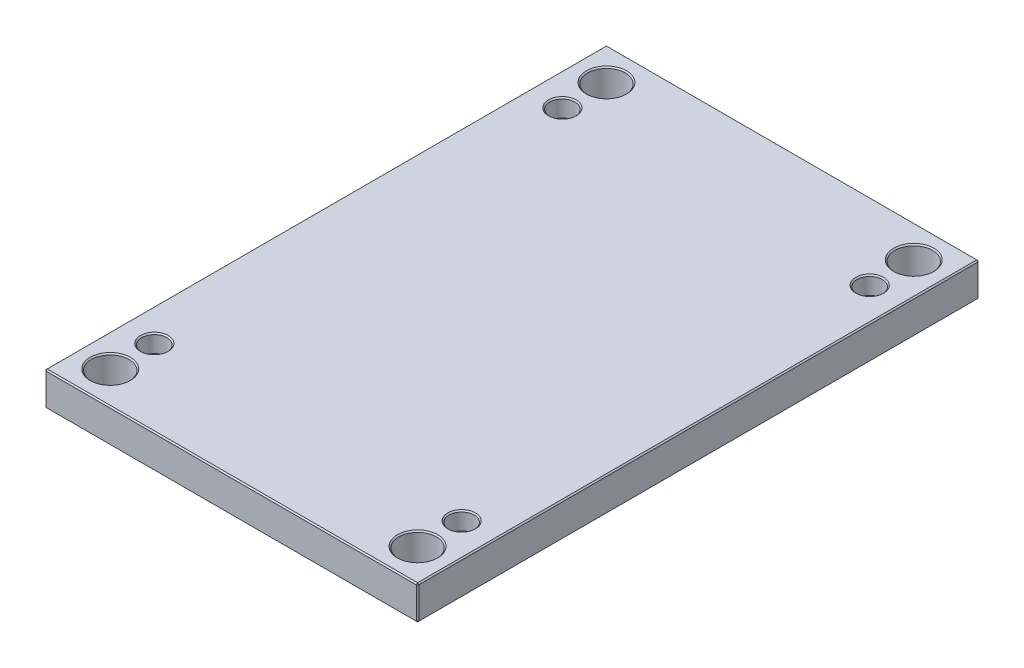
ISO-10303-21;
HEADER;
FILE_DESCRIPTION(('STEP AP214'),'2;1');
FILE_NAME('part.step','',(''),(''),'','','');
FILE_SCHEMA(('AUTOMOTIVE_DESIGN { 1 0 10303 214 1 1 1 1 }'));
ENDSEC;
DATA;
#1=APPLICATION_CONTEXT('core data for automotive mechanical design processes');
#2=APPLICATION_PROTOCOL_DEFINITION('international standard','automotive_design',2000,#1);
#3=PRODUCT_CONTEXT('',#1,'mechanical');
#4=PRODUCT('Part','Part','',(#3));
#5=PRODUCT_RELATED_PRODUCT_CATEGORY('part','',(#4));
#6=PRODUCT_DEFINITION_FORMATION('','',#4);
#7=PRODUCT_DEFINITION_CONTEXT('part definition',#1,'design');
#8=PRODUCT_DEFINITION('design','',#6,#7);
#9=PRODUCT_DEFINITION_SHAPE('','',#8);
#10=(LENGTH_UNIT() NAMED_UNIT(*) SI_UNIT(.MILLI.,.METRE.));
#11=(NAMED_UNIT(*) PLANE_ANGLE_UNIT() SI_UNIT($,.RADIAN.));
#12=(NAMED_UNIT(*) SI_UNIT($,.STERADIAN.) SOLID_ANGLE_UNIT());
#13=UNCERTAINTY_MEASURE_WITH_UNIT(LENGTH_MEASURE(1.E-05),#10,'distance_accuracy_value','');
#14=(GEOMETRIC_REPRESENTATION_CONTEXT(3) GLOBAL_UNCERTAINTY_ASSIGNED_CONTEXT((#13)) GLOBAL_UNIT_ASSIGNED_CONTEXT((#10,
#11,#12)) REPRESENTATION_CONTEXT('',''));
#15=CARTESIAN_POINT('',(0.,0.,0.));
#16=DIRECTION('',(0.,0.,1.));
#17=DIRECTION('',(1.,0.,0.));
#18=AXIS2_PLACEMENT_3D('',#15,#16,#17);
#19=CARTESIAN_POINT('',(-148.,27.,223.));
#20=DIRECTION('',(1.,0.,0.));
#21=DIRECTION('',(0.,0.,-1.));
#22=AXIS2_PLACEMENT_3D('',#19,#20,#21);
#23=PLANE('',#22);
#24=DIRECTION('',(0.,-1.,0.));
#25=VECTOR('',#24,1.);
#26=CARTESIAN_POINT('',(-148.,27.,-222.));
#27=LINE('',#26,#25);
#28=CARTESIAN_POINT('',(-148.,26.,-222.));
#29=VERTEX_POINT('',#28);
#30=CARTESIAN_POINT('',(-148.,1.,-222.));
#31=VERTEX_POINT('',#30);
#32=EDGE_CURVE('E115',#29,#31,#27,.T.);
#33=ORIENTED_EDGE('',*,*,#32,.T.);
#34=DIRECTION('',(0.,0.,1.));
#35=VECTOR('',#34,1.);
#36=CARTESIAN_POINT('',(-148.,1.,223.));
#37=LINE('',#36,#35);
#38=CARTESIAN_POINT('',(-148.,1.,222.));
#39=VERTEX_POINT('',#38);
#40=EDGE_CURVE('E111',#31,#39,#37,.T.);
#41=ORIENTED_EDGE('',*,*,#40,.T.);
#42=DIRECTION('',(0.,1.,0.));
#43=VECTOR('',#42,1.);
#44=CARTESIAN_POINT('',(-148.,27.,222.));
#45=LINE('',#44,#43);
#46=CARTESIAN_POINT('',(-148.,26.,222.));
#47=VERTEX_POINT('',#46);
#48=EDGE_CURVE('E104',#39,#47,#45,.T.);
#49=ORIENTED_EDGE('',*,*,#48,.T.);
#50=DIRECTION('',(0.,0.,-1.));
#51=VECTOR('',#50,1.);
#52=CARTESIAN_POINT('',(-148.,26.,-223.));
#53=LINE('',#52,#51);
#54=EDGE_CURVE('E108',#47,#29,#53,.T.);
#55=ORIENTED_EDGE('',*,*,#54,.T.);
#56=EDGE_LOOP('',(#33,#41,#49,#55));
#57=FACE_BOUND('',#56,.T.);
#58=ADVANCED_FACE('F16',(#57),#23,.F.);
#59=CARTESIAN_POINT('',(148.,27.,223.));
#60=DIRECTION('',(0.,0.,-1.));
#61=DIRECTION('',(-1.,0.,0.));
#62=AXIS2_PLACEMENT_3D('',#59,#60,#61);
#63=PLANE('',#62);
#64=DIRECTION('',(-1.,0.,0.));
#65=VECTOR('',#64,1.);
#66=CARTESIAN_POINT('',(-148.,26.,223.));
#67=LINE('',#66,#65);
#68=CARTESIAN_POINT('',(147.,26.,223.));
#69=VERTEX_POINT('',#68);
#70=CARTESIAN_POINT('',(-147.,26.,223.));
#71=VERTEX_POINT('',#70);
#72=EDGE_CURVE('E170',#69,#71,#67,.T.);
#73=ORIENTED_EDGE('',*,*,#72,.T.);
#74=DIRECTION('',(0.,-1.,0.));
#75=VECTOR('',#74,1.);
#76=CARTESIAN_POINT('',(-147.,27.,223.));
#77=LINE('',#76,#75);
#78=CARTESIAN_POINT('',(-147.,0.999999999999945,223.));
#79=VERTEX_POINT('',#78);
#80=EDGE_CURVE('E123',#71,#79,#77,.T.);
#81=ORIENTED_EDGE('',*,*,#80,.T.);
#82=DIRECTION('',(1.,0.,0.));
#83=VECTOR('',#82,1.);
#84=CARTESIAN_POINT('',(148.,0.999999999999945,223.));
#85=LINE('',#84,#83);
#86=CARTESIAN_POINT('',(147.,0.999999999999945,223.));
#87=VERTEX_POINT('',#86);
#88=EDGE_CURVE('E174',#79,#87,#85,.T.);
#89=ORIENTED_EDGE('',*,*,#88,.T.);
#90=DIRECTION('',(0.,1.,0.));
#91=VECTOR('',#90,1.);
#92=CARTESIAN_POINT('',(147.,27.,223.));
#93=LINE('',#92,#91);
#94=EDGE_CURVE('E172',#87,#69,#93,.T.);
#95=ORIENTED_EDGE('',*,*,#94,.T.);
#96=EDGE_LOOP('',(#73,#81,#89,#95));
#97=FACE_BOUND('',#96,.T.);
#98=ADVANCED_FACE('F413',(#97),#63,.F.);
#99=CARTESIAN_POINT('',(148.,27.,223.));
#100=DIRECTION('',(-1.,0.,0.));
#101=DIRECTION('',(0.,0.,1.));
#102=AXIS2_PLACEMENT_3D('',#99,#100,#101);
#103=PLANE('',#102);
#104=DIRECTION('',(0.,0.,-1.));
#105=VECTOR('',#104,1.);
#106=CARTESIAN_POINT('',(148.,0.999999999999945,223.));
#107=LINE('',#106,#105);
#108=CARTESIAN_POINT('',(148.,0.999999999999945,222.));
#109=VERTEX_POINT('',#108);
#110=CARTESIAN_POINT('',(148.,0.999999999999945,-222.));
#111=VERTEX_POINT('',#110);
#112=EDGE_CURVE('E165',#109,#111,#107,.T.);
#113=ORIENTED_EDGE('',*,*,#112,.T.);
#114=DIRECTION('',(0.,1.,0.));
#115=VECTOR('',#114,1.);
#116=CARTESIAN_POINT('',(148.,27.,-222.));
#117=LINE('',#116,#115);
#118=CARTESIAN_POINT('',(148.,26.,-222.));
#119=VERTEX_POINT('',#118);
#120=EDGE_CURVE('E167',#111,#119,#117,.T.);
#121=ORIENTED_EDGE('',*,*,#120,.T.);
#122=DIRECTION('',(0.,0.,1.));
#123=VECTOR('',#122,1.);
#124=CARTESIAN_POINT('',(148.,26.,223.));
#125=LINE('',#124,#123);
#126=CARTESIAN_POINT('',(148.,26.,222.));
#127=VERTEX_POINT('',#126);
#128=EDGE_CURVE('E161',#119,#127,#125,.T.);
#129=ORIENTED_EDGE('',*,*,#128,.T.);
#130=DIRECTION('',(0.,-1.,0.));
#131=VECTOR('',#130,1.);
#132=CARTESIAN_POINT('',(148.,27.,222.));
#133=LINE('',#132,#131);
#134=EDGE_CURVE('E163',#127,#109,#133,.T.);
#135=ORIENTED_EDGE('',*,*,#134,.T.);
#136=EDGE_LOOP('',(#113,#121,#129,#135));
#137=FACE_BOUND('',#136,.T.);
#138=ADVANCED_FACE('F406',(#137),#103,.F.);
#139=CARTESIAN_POINT('',(148.,27.,-223.));
#140=DIRECTION('',(0.,0.,1.));
#141=DIRECTION('',(1.,0.,0.));
#142=AXIS2_PLACEMENT_3D('',#139,#140,#141);
#143=PLANE('',#142);
#144=DIRECTION('',(0.,-1.,0.));
#145=VECTOR('',#144,1.);
#146=CARTESIAN_POINT('',(147.,27.,-223.));
#147=LINE('',#146,#145);
#148=CARTESIAN_POINT('',(147.,26.,-223.));
#149=VERTEX_POINT('',#148);
#150=CARTESIAN_POINT('',(147.,0.999999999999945,-223.));
#151=VERTEX_POINT('',#150);
#152=EDGE_CURVE('E154',#149,#151,#147,.T.);
#153=ORIENTED_EDGE('',*,*,#152,.T.);
#154=DIRECTION('',(-1.,0.,0.));
#155=VECTOR('',#154,1.);
#156=CARTESIAN_POINT('',(148.,0.999999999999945,-223.));
#157=LINE('',#156,#155);
#158=CARTESIAN_POINT('',(-147.,0.999999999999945,-223.));
#159=VERTEX_POINT('',#158);
#160=EDGE_CURVE('E159',#151,#159,#157,.T.);
#161=ORIENTED_EDGE('',*,*,#160,.T.);
#162=DIRECTION('',(0.,1.,0.));
#163=VECTOR('',#162,1.);
#164=CARTESIAN_POINT('',(-147.,27.,-223.));
#165=LINE('',#164,#163);
#166=CARTESIAN_POINT('',(-147.,26.,-223.));
#167=VERTEX_POINT('',#166);
#168=EDGE_CURVE('E156',#159,#167,#165,.T.);
#169=ORIENTED_EDGE('',*,*,#168,.T.);
#170=DIRECTION('',(1.,0.,0.));
#171=VECTOR('',#170,1.);
#172=CARTESIAN_POINT('',(148.,26.,-223.));
#173=LINE('',#172,#171);
#174=EDGE_CURVE('E152',#167,#149,#173,.T.);
#175=ORIENTED_EDGE('',*,*,#174,.T.);
#176=EDGE_LOOP('',(#153,#161,#169,#175));
#177=FACE_BOUND('',#176,.T.);
#178=ADVANCED_FACE('F431',(#177),#143,.F.);
#179=CARTESIAN_POINT('',(0.,27.,0.));
#180=DIRECTION('',(0.,1.,0.));
#181=DIRECTION('',(0.,0.,1.));
#182=AXIS2_PLACEMENT_3D('',#179,#180,#181);
#183=PLANE('',#182);
#184=CARTESIAN_POINT('',(-122.,27.,197.));
#185=DIRECTION('',(0.,1.,0.));
#186=DIRECTION('',(0.,0.,1.));
#187=AXIS2_PLACEMENT_3D('',#184,#185,#186);
#188=CIRCLE('',#187,16.);
#189=CARTESIAN_POINT('',(-122.,27.,213.));
#190=VERTEX_POINT('',#189);
#191=EDGE_CURVE('E317',#190,#190,#188,.F.);
#192=ORIENTED_EDGE('',*,*,#191,.T.);
#193=EDGE_LOOP('',(#192));
#194=FACE_BOUND('',#193,.T.);
#195=CARTESIAN_POINT('',(122.,27.,197.));
#196=DIRECTION('',(0.,1.,0.));
#197=DIRECTION('',(0.,0.,1.));
#198=AXIS2_PLACEMENT_3D('',#195,#196,#197);
#199=CIRCLE('',#198,16.);
#200=CARTESIAN_POINT('',(122.,27.,213.));
#201=VERTEX_POINT('',#200);
#202=EDGE_CURVE('E314',#201,#201,#199,.F.);
#203=ORIENTED_EDGE('',*,*,#202,.T.);
#204=EDGE_LOOP('',(#203));
#205=FACE_BOUND('',#204,.T.);
#206=CARTESIAN_POINT('',(122.,27.,-197.));
#207=DIRECTION('',(0.,1.,0.));
#208=DIRECTION('',(0.,0.,1.));
#209=AXIS2_PLACEMENT_3D('',#206,#207,#208);
#210=CIRCLE('',#209,16.);
#211=CARTESIAN_POINT('',(122.,27.,-181.));
#212=VERTEX_POINT('',#211);
#213=EDGE_CURVE('E311',#212,#212,#210,.F.);
#214=ORIENTED_EDGE('',*,*,#213,.T.);
#215=EDGE_LOOP('',(#214));
#216=FACE_BOUND('',#215,.T.);
#217=CARTESIAN_POINT('',(-122.,27.,-197.));
#218=DIRECTION('',(0.,1.,0.));
#219=DIRECTION('',(0.,0.,1.));
#220=AXIS2_PLACEMENT_3D('',#217,#218,#219);
#221=CIRCLE('',#220,16.);
#222=CARTESIAN_POINT('',(-122.,27.,-181.));
#223=VERTEX_POINT('',#222);
#224=EDGE_CURVE('E308',#223,#223,#221,.F.);
#225=ORIENTED_EDGE('',*,*,#224,.T.);
#226=EDGE_LOOP('',(#225));
#227=FACE_BOUND('',#226,.T.);
#228=CARTESIAN_POINT('',(-122.,27.,162.));
#229=DIRECTION('',(0.,1.,0.));
#230=DIRECTION('',(0.,0.,1.));
#231=AXIS2_PLACEMENT_3D('',#228,#229,#230);
#232=CIRCLE('',#231,11.);
#233=CARTESIAN_POINT('',(-122.,27.,173.));
#234=VERTEX_POINT('',#233);
#235=EDGE_CURVE('E290',#234,#234,#232,.F.);
#236=ORIENTED_EDGE('',*,*,#235,.T.);
#237=EDGE_LOOP('',(#236));
#238=FACE_BOUND('',#237,.T.);
#239=CARTESIAN_POINT('',(122.,27.,162.));
#240=DIRECTION('',(0.,1.,0.));
#241=DIRECTION('',(0.,0.,1.));
#242=AXIS2_PLACEMENT_3D('',#239,#240,#241);
#243=CIRCLE('',#242,11.);
#244=CARTESIAN_POINT('',(122.,27.,173.));
#245=VERTEX_POINT('',#244);
#246=EDGE_CURVE('E287',#245,#245,#243,.F.);
#247=ORIENTED_EDGE('',*,*,#246,.T.);
#248=EDGE_LOOP('',(#247));
#249=FACE_BOUND('',#248,.T.);
#250=CARTESIAN_POINT('',(122.,27.,-162.));
#251=DIRECTION('',(0.,1.,0.));
#252=DIRECTION('',(0.,0.,1.));
#253=AXIS2_PLACEMENT_3D('',#250,#251,#252);
#254=CIRCLE('',#253,11.);
#255=CARTESIAN_POINT('',(122.,27.,-151.));
#256=VERTEX_POINT('',#255);
#257=EDGE_CURVE('E284',#256,#256,#254,.F.);
#258=ORIENTED_EDGE('',*,*,#257,.T.);
#259=EDGE_LOOP('',(#258));
#260=FACE_BOUND('',#259,.T.);
#261=CARTESIAN_POINT('',(-122.,27.,-162.));
#262=DIRECTION('',(0.,1.,0.));
#263=DIRECTION('',(0.,0.,1.));
#264=AXIS2_PLACEMENT_3D('',#261,#262,#263);
#265=CIRCLE('',#264,11.);
#266=CARTESIAN_POINT('',(-122.,27.,-151.));
#267=VERTEX_POINT('',#266);
#268=EDGE_CURVE('E281',#267,#267,#265,.F.);
#269=ORIENTED_EDGE('',*,*,#268,.T.);
#270=EDGE_LOOP('',(#269));
#271=FACE_BOUND('',#270,.T.);
#272=DIRECTION('',(0.,0.,-1.));
#273=VECTOR('',#272,1.);
#274=CARTESIAN_POINT('',(147.,27.,-223.));
#275=LINE('',#274,#273);
#276=CARTESIAN_POINT('',(147.,27.,222.));
#277=VERTEX_POINT('',#276);
#278=CARTESIAN_POINT('',(147.,27.,-222.));
#279=VERTEX_POINT('',#278);
#280=EDGE_CURVE('E31',#277,#279,#275,.T.);
#281=ORIENTED_EDGE('',*,*,#280,.T.);
#282=DIRECTION('',(-1.,0.,0.));
#283=VECTOR('',#282,1.);
#284=CARTESIAN_POINT('',(-148.,27.,-222.));
#285=LINE('',#284,#283);
#286=CARTESIAN_POINT('',(-147.,27.,-222.));
#287=VERTEX_POINT('',#286);
#288=EDGE_CURVE('E190',#279,#287,#285,.T.);
#289=ORIENTED_EDGE('',*,*,#288,.T.);
#290=DIRECTION('',(0.,0.,1.));
#291=VECTOR('',#290,1.);
#292=CARTESIAN_POINT('',(-147.,27.,223.));
#293=LINE('',#292,#291);
#294=CARTESIAN_POINT('',(-147.,27.,222.));
#295=VERTEX_POINT('',#294);
#296=EDGE_CURVE('E186',#287,#295,#293,.T.);
#297=ORIENTED_EDGE('',*,*,#296,.T.);
#298=DIRECTION('',(1.,0.,0.));
#299=VECTOR('',#298,1.);
#300=CARTESIAN_POINT('',(148.,27.,222.));
#301=LINE('',#300,#299);
#302=EDGE_CURVE('E36',#295,#277,#301,.T.);
#303=ORIENTED_EDGE('',*,*,#302,.T.);
#304=EDGE_LOOP('',(#281,#289,#297,#303));
#305=FACE_BOUND('',#304,.T.);
#306=ADVANCED_FACE('F357',(#194,#205,#216,#227,#238,#249,#260,#271,#305),#183,.T.);
#307=CARTESIAN_POINT('',(0.,0.,0.));
#308=DIRECTION('',(0.,1.,0.));
#309=DIRECTION('',(0.,0.,1.));
#310=AXIS2_PLACEMENT_3D('',#307,#308,#309);
#311=PLANE('',#310);
#312=CARTESIAN_POINT('',(-122.,0.,197.));
#313=DIRECTION('',(0.,1.,0.));
#314=DIRECTION('',(0.,0.,1.));
#315=AXIS2_PLACEMENT_3D('',#312,#313,#314);
#316=CIRCLE('',#315,16.);
#317=CARTESIAN_POINT('',(-122.,0.,213.));
#318=VERTEX_POINT('',#317);
#319=EDGE_CURVE('E329',#318,#318,#316,.T.);
#320=ORIENTED_EDGE('',*,*,#319,.T.);
#321=EDGE_LOOP('',(#320));
#322=FACE_BOUND('',#321,.T.);
#323=CARTESIAN_POINT('',(122.,0.,197.));
#324=DIRECTION('',(0.,1.,0.));
#325=DIRECTION('',(0.,0.,1.));
#326=AXIS2_PLACEMENT_3D('',#323,#324,#325);
#327=CIRCLE('',#326,16.);
#328=CARTESIAN_POINT('',(122.,0.,213.));
#329=VERTEX_POINT('',#328);
#330=EDGE_CURVE('E326',#329,#329,#327,.T.);
#331=ORIENTED_EDGE('',*,*,#330,.T.);
#332=EDGE_LOOP('',(#331));
#333=FACE_BOUND('',#332,.T.);
#334=CARTESIAN_POINT('',(122.,0.,-197.));
#335=DIRECTION('',(0.,1.,0.));
#336=DIRECTION('',(0.,0.,1.));
#337=AXIS2_PLACEMENT_3D('',#334,#335,#336);
#338=CIRCLE('',#337,16.);
#339=CARTESIAN_POINT('',(122.,0.,-181.));
#340=VERTEX_POINT('',#339);
#341=EDGE_CURVE('E323',#340,#340,#338,.T.);
#342=ORIENTED_EDGE('',*,*,#341,.T.);
#343=EDGE_LOOP('',(#342));
#344=FACE_BOUND('',#343,.T.);
#345=CARTESIAN_POINT('',(-122.,0.,-197.));
#346=DIRECTION('',(0.,1.,0.));
#347=DIRECTION('',(0.,0.,1.));
#348=AXIS2_PLACEMENT_3D('',#345,#346,#347);
#349=CIRCLE('',#348,16.);
#350=CARTESIAN_POINT('',(-122.,0.,-181.));
#351=VERTEX_POINT('',#350);
#352=EDGE_CURVE('E320',#351,#351,#349,.T.);
#353=ORIENTED_EDGE('',*,*,#352,.T.);
#354=EDGE_LOOP('',(#353));
#355=FACE_BOUND('',#354,.T.);
#356=CARTESIAN_POINT('',(122.,0.,-162.));
#357=DIRECTION('',(0.,1.,0.));
#358=DIRECTION('',(0.,0.,1.));
#359=AXIS2_PLACEMENT_3D('',#356,#357,#358);
#360=CIRCLE('',#359,7.9999999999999);
#361=CARTESIAN_POINT('',(122.,0.,-154.));
#362=VERTEX_POINT('',#361);
#363=EDGE_CURVE('E263',#362,#362,#360,.T.);
#364=ORIENTED_EDGE('',*,*,#363,.T.);
#365=EDGE_LOOP('',(#364));
#366=FACE_BOUND('',#365,.T.);
#367=CARTESIAN_POINT('',(122.,0.,162.));
#368=DIRECTION('',(0.,1.,0.));
#369=DIRECTION('',(0.,0.,1.));
#370=AXIS2_PLACEMENT_3D('',#367,#368,#369);
#371=CIRCLE('',#370,7.9999999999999);
#372=CARTESIAN_POINT('',(122.,0.,170.));
#373=VERTEX_POINT('',#372);
#374=EDGE_CURVE('E260',#373,#373,#371,.T.);
#375=ORIENTED_EDGE('',*,*,#374,.T.);
#376=EDGE_LOOP('',(#375));
#377=FACE_BOUND('',#376,.T.);
#378=CARTESIAN_POINT('',(-122.,0.,162.));
#379=DIRECTION('',(0.,1.,0.));
#380=DIRECTION('',(0.,0.,1.));
#381=AXIS2_PLACEMENT_3D('',#378,#379,#380);
#382=CIRCLE('',#381,7.9999999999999);
#383=CARTESIAN_POINT('',(-122.,0.,170.));
#384=VERTEX_POINT('',#383);
#385=EDGE_CURVE('E257',#384,#384,#382,.T.);
#386=ORIENTED_EDGE('',*,*,#385,.T.);
#387=EDGE_LOOP('',(#386));
#388=FACE_BOUND('',#387,.T.);
#389=CARTESIAN_POINT('',(-122.,0.,-162.));
#390=DIRECTION('',(0.,1.,0.));
#391=DIRECTION('',(0.,0.,1.));
#392=AXIS2_PLACEMENT_3D('',#389,#390,#391);
#393=CIRCLE('',#392,7.9999999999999);
#394=CARTESIAN_POINT('',(-122.,0.,-154.));
#395=VERTEX_POINT('',#394);
#396=EDGE_CURVE('E192',#395,#395,#393,.T.);
#397=ORIENTED_EDGE('',*,*,#396,.T.);
#398=EDGE_LOOP('',(#397));
#399=FACE_BOUND('',#398,.T.);
#400=DIRECTION('',(0.,0.,1.));
#401=VECTOR('',#400,1.);
#402=CARTESIAN_POINT('',(147.,0.,0.));
#403=LINE('',#402,#401);
#404=CARTESIAN_POINT('',(147.,0.,-222.));
#405=VERTEX_POINT('',#404);
#406=CARTESIAN_POINT('',(147.,0.,222.));
#407=VERTEX_POINT('',#406);
#408=EDGE_CURVE('E177',#405,#407,#403,.T.);
#409=ORIENTED_EDGE('',*,*,#408,.T.);
#410=DIRECTION('',(-1.,0.,0.));
#411=VECTOR('',#410,1.);
#412=CARTESIAN_POINT('',(0.,0.,222.));
#413=LINE('',#412,#411);
#414=CARTESIAN_POINT('',(-147.,0.,222.));
#415=VERTEX_POINT('',#414);
#416=EDGE_CURVE('E183',#407,#415,#413,.T.);
#417=ORIENTED_EDGE('',*,*,#416,.T.);
#418=DIRECTION('',(0.,0.,-1.));
#419=VECTOR('',#418,1.);
#420=CARTESIAN_POINT('',(-147.,0.,0.));
#421=LINE('',#420,#419);
#422=CARTESIAN_POINT('',(-147.,0.,-222.));
#423=VERTEX_POINT('',#422);
#424=EDGE_CURVE('E181',#415,#423,#421,.T.);
#425=ORIENTED_EDGE('',*,*,#424,.T.);
#426=DIRECTION('',(1.,0.,0.));
#427=VECTOR('',#426,1.);
#428=CARTESIAN_POINT('',(0.,0.,-222.));
#429=LINE('',#428,#427);
#430=EDGE_CURVE('E179',#423,#405,#429,.T.);
#431=ORIENTED_EDGE('',*,*,#430,.T.);
#432=EDGE_LOOP('',(#409,#417,#425,#431));
#433=FACE_BOUND('',#432,.T.);
#434=ADVANCED_FACE('F353',(#322,#333,#344,#355,#366,#377,#388,#399,#433),#311,.F.);
#435=CARTESIAN_POINT('',(148.,27.,222.));
#436=DIRECTION('',(-0.707106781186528,0.,-0.707106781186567));
#437=DIRECTION('',(0.,-1.,0.));
#438=AXIS2_PLACEMENT_3D('',#435,#436,#437);
#439=PLANE('',#438);
#440=DIRECTION('',(-0.707106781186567,0.,0.707106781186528));
#441=VECTOR('',#440,1.);
#442=CARTESIAN_POINT('',(147.,26.,223.));
#443=LINE('',#442,#441);
#444=EDGE_CURVE('E141',#69,#127,#443,.F.);
#445=ORIENTED_EDGE('',*,*,#444,.F.);
#446=ORIENTED_EDGE('',*,*,#94,.F.);
#447=DIRECTION('',(0.707106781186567,0.,-0.707106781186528));
#448=VECTOR('',#447,1.);
#449=CARTESIAN_POINT('',(147.,0.999999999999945,223.));
#450=LINE('',#449,#448);
#451=EDGE_CURVE('E144',#109,#87,#450,.F.);
#452=ORIENTED_EDGE('',*,*,#451,.F.);
#453=ORIENTED_EDGE('',*,*,#134,.F.);
#454=EDGE_LOOP('',(#445,#446,#452,#453));
#455=FACE_BOUND('',#454,.T.);
#456=ADVANCED_FACE('F356',(#455),#439,.F.);
#457=CARTESIAN_POINT('',(147.,26.,223.));
#458=DIRECTION('',(0.577350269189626,0.577350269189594,0.577350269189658));
#459=DIRECTION('',(0.707106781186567,0.,-0.707106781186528));
#460=AXIS2_PLACEMENT_3D('',#457,#458,#459);
#461=PLANE('',#460);
#462=DIRECTION('',(0.,-0.707106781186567,0.707106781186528));
#463=VECTOR('',#462,1.);
#464=CARTESIAN_POINT('',(147.,26.,223.));
#465=LINE('',#464,#463);
#466=EDGE_CURVE('E235',#69,#277,#465,.F.);
#467=ORIENTED_EDGE('',*,*,#466,.F.);
#468=ORIENTED_EDGE('',*,*,#444,.T.);
#469=DIRECTION('',(-0.707106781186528,0.707106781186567,0.));
#470=VECTOR('',#469,1.);
#471=CARTESIAN_POINT('',(147.5,26.5,222.));
#472=LINE('',#471,#470);
#473=EDGE_CURVE('E237',#277,#127,#472,.F.);
#474=ORIENTED_EDGE('',*,*,#473,.F.);
#475=EDGE_LOOP('',(#467,#468,#474));
#476=FACE_BOUND('',#475,.T.);
#477=ADVANCED_FACE('F419',(#476),#461,.T.);
#478=CARTESIAN_POINT('',(147.,0.999999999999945,223.));
#479=DIRECTION('',(0.577350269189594,-0.577350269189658,0.577350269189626));
#480=DIRECTION('',(0.,-0.707106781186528,-0.707106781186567));
#481=AXIS2_PLACEMENT_3D('',#478,#479,#480);
#482=PLANE('',#481);
#483=DIRECTION('',(-0.707106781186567,-0.707106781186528,0.));
#484=VECTOR('',#483,1.);
#485=CARTESIAN_POINT('',(147.5,0.499999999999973,222.));
#486=LINE('',#485,#484);
#487=EDGE_CURVE('E229',#109,#407,#486,.T.);
#488=ORIENTED_EDGE('',*,*,#487,.F.);
#489=ORIENTED_EDGE('',*,*,#451,.T.);
#490=DIRECTION('',(0.,0.707106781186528,0.707106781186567));
#491=VECTOR('',#490,1.);
#492=CARTESIAN_POINT('',(147.,0.999999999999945,223.));
#493=LINE('',#492,#491);
#494=EDGE_CURVE('E232',#407,#87,#493,.T.);
#495=ORIENTED_EDGE('',*,*,#494,.F.);
#496=EDGE_LOOP('',(#488,#489,#495));
#497=FACE_BOUND('',#496,.T.);
#498=ADVANCED_FACE('F378',(#497),#482,.T.);
#499=CARTESIAN_POINT('',(147.,27.,0.));
#500=DIRECTION('',(0.707106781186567,0.707106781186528,0.));
#501=DIRECTION('',(0.,0.,1.));
#502=AXIS2_PLACEMENT_3D('',#499,#500,#501);
#503=PLANE('',#502);
#504=ORIENTED_EDGE('',*,*,#473,.T.);
#505=ORIENTED_EDGE('',*,*,#128,.F.);
#506=DIRECTION('',(0.707106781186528,-0.707106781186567,0.));
#507=VECTOR('',#506,1.);
#508=CARTESIAN_POINT('',(148.,26.,-222.));
#509=LINE('',#508,#507);
#510=EDGE_CURVE('E224',#279,#119,#509,.T.);
#511=ORIENTED_EDGE('',*,*,#510,.F.);
#512=ORIENTED_EDGE('',*,*,#280,.F.);
#513=EDGE_LOOP('',(#504,#505,#511,#512));
#514=FACE_BOUND('',#513,.T.);
#515=ADVANCED_FACE('F421',(#514),#503,.T.);
#516=CARTESIAN_POINT('',(0.,27.,222.));
#517=DIRECTION('',(0.,0.707106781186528,0.707106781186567));
#518=DIRECTION('',(-1.,0.,0.));
#519=AXIS2_PLACEMENT_3D('',#516,#517,#518);
#520=PLANE('',#519);
#521=ORIENTED_EDGE('',*,*,#466,.T.);
#522=ORIENTED_EDGE('',*,*,#302,.F.);
#523=DIRECTION('',(0.,0.707106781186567,-0.707106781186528));
#524=VECTOR('',#523,1.);
#525=CARTESIAN_POINT('',(-147.,26.5,222.5));
#526=LINE('',#525,#524);
#527=EDGE_CURVE('E127',#71,#295,#526,.T.);
#528=ORIENTED_EDGE('',*,*,#527,.F.);
#529=ORIENTED_EDGE('',*,*,#72,.F.);
#530=EDGE_LOOP('',(#521,#522,#528,#529));
#531=FACE_BOUND('',#530,.T.);
#532=ADVANCED_FACE('F416',(#531),#520,.T.);
#533=CARTESIAN_POINT('',(-147.,27.,223.));
#534=DIRECTION('',(0.707106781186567,0.,-0.707106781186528));
#535=DIRECTION('',(0.,-1.,0.));
#536=AXIS2_PLACEMENT_3D('',#533,#534,#535);
#537=PLANE('',#536);
#538=DIRECTION('',(0.707106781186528,0.,0.707106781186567));
#539=VECTOR('',#538,1.);
#540=CARTESIAN_POINT('',(-147.,0.999999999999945,223.));
#541=LINE('',#540,#539);
#542=EDGE_CURVE('E128',#79,#39,#541,.F.);
#543=ORIENTED_EDGE('',*,*,#542,.F.);
#544=ORIENTED_EDGE('',*,*,#80,.F.);
#545=DIRECTION('',(-0.707106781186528,0.,-0.707106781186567));
#546=VECTOR('',#545,1.);
#547=CARTESIAN_POINT('',(-148.,26.,222.));
#548=LINE('',#547,#546);
#549=EDGE_CURVE('E119',#47,#71,#548,.F.);
#550=ORIENTED_EDGE('',*,*,#549,.F.);
#551=ORIENTED_EDGE('',*,*,#48,.F.);
#552=EDGE_LOOP('',(#543,#544,#550,#551));
#553=FACE_BOUND('',#552,.T.);
#554=ADVANCED_FACE('F121',(#553),#537,.F.);
#555=CARTESIAN_POINT('',(148.,0.999999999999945,223.));
#556=DIRECTION('',(0.,0.707106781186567,-0.707106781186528));
#557=DIRECTION('',(1.,0.,0.));
#558=AXIS2_PLACEMENT_3D('',#555,#556,#557);
#559=PLANE('',#558);
#560=ORIENTED_EDGE('',*,*,#494,.T.);
#561=ORIENTED_EDGE('',*,*,#88,.F.);
#562=DIRECTION('',(0.,-0.707106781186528,-0.707106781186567));
#563=VECTOR('',#562,1.);
#564=CARTESIAN_POINT('',(-147.,0.999999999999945,223.));
#565=LINE('',#564,#563);
#566=EDGE_CURVE('E220',#415,#79,#565,.F.);
#567=ORIENTED_EDGE('',*,*,#566,.F.);
#568=ORIENTED_EDGE('',*,*,#416,.F.);
#569=EDGE_LOOP('',(#560,#561,#567,#568));
#570=FACE_BOUND('',#569,.T.);
#571=ADVANCED_FACE('F383',(#570),#559,.F.);
#572=CARTESIAN_POINT('',(148.,0.999999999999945,223.));
#573=DIRECTION('',(-0.707106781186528,0.707106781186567,0.));
#574=DIRECTION('',(0.,0.,-1.));
#575=AXIS2_PLACEMENT_3D('',#572,#573,#574);
#576=PLANE('',#575);
#577=ORIENTED_EDGE('',*,*,#487,.T.);
#578=ORIENTED_EDGE('',*,*,#408,.F.);
#579=DIRECTION('',(0.707106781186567,0.707106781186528,0.));
#580=VECTOR('',#579,1.);
#581=CARTESIAN_POINT('',(147.5,0.499999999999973,-222.));
#582=LINE('',#581,#580);
#583=EDGE_CURVE('E217',#111,#405,#582,.F.);
#584=ORIENTED_EDGE('',*,*,#583,.F.);
#585=ORIENTED_EDGE('',*,*,#112,.F.);
#586=EDGE_LOOP('',(#577,#578,#584,#585));
#587=FACE_BOUND('',#586,.T.);
#588=ADVANCED_FACE('F376',(#587),#576,.F.);
#589=CARTESIAN_POINT('',(147.,27.,-223.));
#590=DIRECTION('',(-0.707106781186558,0.,0.707106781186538));
#591=DIRECTION('',(0.,-1.,0.));
#592=AXIS2_PLACEMENT_3D('',#589,#590,#591);
#593=PLANE('',#592);
#594=DIRECTION('',(0.707106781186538,0.,0.707106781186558));
#595=VECTOR('',#594,1.);
#596=CARTESIAN_POINT('',(148.,26.,-222.));
#597=LINE('',#596,#595);
#598=EDGE_CURVE('E226',#119,#149,#597,.F.);
#599=ORIENTED_EDGE('',*,*,#598,.F.);
#600=ORIENTED_EDGE('',*,*,#120,.F.);
#601=DIRECTION('',(-0.707106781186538,0.,-0.707106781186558));
#602=VECTOR('',#601,1.);
#603=CARTESIAN_POINT('',(147.,0.999999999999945,-223.));
#604=LINE('',#603,#602);
#605=EDGE_CURVE('E214',#151,#111,#604,.F.);
#606=ORIENTED_EDGE('',*,*,#605,.F.);
#607=ORIENTED_EDGE('',*,*,#152,.F.);
#608=EDGE_LOOP('',(#599,#600,#606,#607));
#609=FACE_BOUND('',#608,.T.);
#610=ADVANCED_FACE('F403',(#609),#593,.F.);
#611=CARTESIAN_POINT('',(148.,26.,-222.));
#612=DIRECTION('',(0.577350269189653,0.577350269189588,-0.577350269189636));
#613=DIRECTION('',(-0.707106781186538,0.,-0.707106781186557));
#614=AXIS2_PLACEMENT_3D('',#611,#612,#613);
#615=PLANE('',#614);
#616=ORIENTED_EDGE('',*,*,#510,.T.);
#617=ORIENTED_EDGE('',*,*,#598,.T.);
#618=DIRECTION('',(0.,0.707106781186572,0.707106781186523));
#619=VECTOR('',#618,1.);
#620=CARTESIAN_POINT('',(147.,26.5,-222.5));
#621=LINE('',#620,#619);
#622=EDGE_CURVE('E135',#279,#149,#621,.F.);
#623=ORIENTED_EDGE('',*,*,#622,.F.);
#624=EDGE_LOOP('',(#616,#617,#623));
#625=FACE_BOUND('',#624,.T.);
#626=ADVANCED_FACE('F425',(#625),#615,.T.);
#627=CARTESIAN_POINT('',(-148.,26.,222.));
#628=DIRECTION('',(-0.577350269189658,0.577350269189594,0.577350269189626));
#629=DIRECTION('',(0.707106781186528,0.,0.707106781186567));
#630=AXIS2_PLACEMENT_3D('',#627,#628,#629);
#631=PLANE('',#630);
#632=ORIENTED_EDGE('',*,*,#549,.T.);
#633=ORIENTED_EDGE('',*,*,#527,.T.);
#634=DIRECTION('',(-0.707106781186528,-0.707106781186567,0.));
#635=VECTOR('',#634,1.);
#636=CARTESIAN_POINT('',(-148.,26.,222.));
#637=LINE('',#636,#635);
#638=EDGE_CURVE('E131',#47,#295,#637,.F.);
#639=ORIENTED_EDGE('',*,*,#638,.F.);
#640=EDGE_LOOP('',(#632,#633,#639));
#641=FACE_BOUND('',#640,.T.);
#642=ADVANCED_FACE('F132',(#641),#631,.T.);
#643=CARTESIAN_POINT('',(-147.,0.999999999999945,223.));
#644=DIRECTION('',(-0.577350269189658,-0.577350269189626,0.577350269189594));
#645=DIRECTION('',(0.707106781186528,-0.707106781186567,0.));
#646=AXIS2_PLACEMENT_3D('',#643,#644,#645);
#647=PLANE('',#646);
#648=ORIENTED_EDGE('',*,*,#566,.T.);
#649=ORIENTED_EDGE('',*,*,#542,.T.);
#650=DIRECTION('',(-0.707106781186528,0.707106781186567,0.));
#651=VECTOR('',#650,1.);
#652=CARTESIAN_POINT('',(-147.5,0.5,222.));
#653=LINE('',#652,#651);
#654=EDGE_CURVE('E136',#415,#39,#653,.T.);
#655=ORIENTED_EDGE('',*,*,#654,.F.);
#656=EDGE_LOOP('',(#648,#649,#655));
#657=FACE_BOUND('',#656,.T.);
#658=ADVANCED_FACE('F386',(#657),#647,.T.);
#659=CARTESIAN_POINT('',(147.,0.999999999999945,-223.));
#660=DIRECTION('',(0.57735026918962,-0.577350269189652,-0.577350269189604));
#661=DIRECTION('',(0.707106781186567,0.707106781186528,0.));
#662=AXIS2_PLACEMENT_3D('',#659,#660,#661);
#663=PLANE('',#662);
#664=ORIENTED_EDGE('',*,*,#605,.T.);
#665=ORIENTED_EDGE('',*,*,#583,.T.);
#666=DIRECTION('',(0.,-0.707106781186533,0.707106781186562));
#667=VECTOR('',#666,1.);
#668=CARTESIAN_POINT('',(147.,0.999999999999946,-223.));
#669=LINE('',#668,#667);
#670=EDGE_CURVE('E207',#151,#405,#669,.T.);
#671=ORIENTED_EDGE('',*,*,#670,.F.);
#672=EDGE_LOOP('',(#664,#665,#671));
#673=FACE_BOUND('',#672,.T.);
#674=ADVANCED_FACE('F397',(#673),#663,.T.);
#675=CARTESIAN_POINT('',(0.,27.,-222.));
#676=DIRECTION('',(0.,0.707106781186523,-0.707106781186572));
#677=DIRECTION('',(1.,0.,0.));
#678=AXIS2_PLACEMENT_3D('',#675,#676,#677);
#679=PLANE('',#678);
#680=ORIENTED_EDGE('',*,*,#622,.T.);
#681=ORIENTED_EDGE('',*,*,#174,.F.);
#682=DIRECTION('',(0.,-0.707106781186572,-0.707106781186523));
#683=VECTOR('',#682,1.);
#684=CARTESIAN_POINT('',(-147.,26.,-223.));
#685=LINE('',#684,#683);
#686=EDGE_CURVE('E204',#287,#167,#685,.T.);
#687=ORIENTED_EDGE('',*,*,#686,.F.);
#688=ORIENTED_EDGE('',*,*,#288,.F.);
#689=EDGE_LOOP('',(#680,#681,#687,#688));
#690=FACE_BOUND('',#689,.T.);
#691=ADVANCED_FACE('F429',(#690),#679,.T.);
#692=CARTESIAN_POINT('',(-147.,27.,0.));
#693=DIRECTION('',(-0.707106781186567,0.707106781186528,0.));
#694=DIRECTION('',(0.,0.,-1.));
#695=AXIS2_PLACEMENT_3D('',#692,#693,#694);
#696=PLANE('',#695);
#697=ORIENTED_EDGE('',*,*,#638,.T.);
#698=ORIENTED_EDGE('',*,*,#296,.F.);
#699=DIRECTION('',(0.707106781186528,0.707106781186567,0.));
#700=VECTOR('',#699,1.);
#701=CARTESIAN_POINT('',(-147.5,26.5,-222.));
#702=LINE('',#701,#700);
#703=EDGE_CURVE('E139',#29,#287,#702,.T.);
#704=ORIENTED_EDGE('',*,*,#703,.F.);
#705=ORIENTED_EDGE('',*,*,#54,.F.);
#706=EDGE_LOOP('',(#697,#698,#704,#705));
#707=FACE_BOUND('',#706,.T.);
#708=ADVANCED_FACE('F138',(#707),#696,.T.);
#709=CARTESIAN_POINT('',(-148.,1.,223.));
#710=DIRECTION('',(0.707106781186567,0.707106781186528,0.));
#711=DIRECTION('',(0.,0.,1.));
#712=AXIS2_PLACEMENT_3D('',#709,#710,#711);
#713=PLANE('',#712);
#714=ORIENTED_EDGE('',*,*,#654,.T.);
#715=ORIENTED_EDGE('',*,*,#40,.F.);
#716=DIRECTION('',(0.707106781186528,-0.707106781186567,0.));
#717=VECTOR('',#716,1.);
#718=CARTESIAN_POINT('',(-148.,1.,-222.));
#719=LINE('',#718,#717);
#720=EDGE_CURVE('E200',#423,#31,#719,.F.);
#721=ORIENTED_EDGE('',*,*,#720,.F.);
#722=ORIENTED_EDGE('',*,*,#424,.F.);
#723=EDGE_LOOP('',(#714,#715,#721,#722));
#724=FACE_BOUND('',#723,.T.);
#725=ADVANCED_FACE('F388',(#724),#713,.F.);
#726=CARTESIAN_POINT('',(148.,0.999999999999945,-223.));
#727=DIRECTION('',(0.,0.707106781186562,0.707106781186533));
#728=DIRECTION('',(-1.,0.,0.));
#729=AXIS2_PLACEMENT_3D('',#726,#727,#728);
#730=PLANE('',#729);
#731=ORIENTED_EDGE('',*,*,#670,.T.);
#732=ORIENTED_EDGE('',*,*,#430,.F.);
#733=DIRECTION('',(0.,0.707106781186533,-0.707106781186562));
#734=VECTOR('',#733,1.);
#735=CARTESIAN_POINT('',(-147.,0.499999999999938,-222.5));
#736=LINE('',#735,#734);
#737=EDGE_CURVE('E197',#159,#423,#736,.F.);
#738=ORIENTED_EDGE('',*,*,#737,.F.);
#739=ORIENTED_EDGE('',*,*,#160,.F.);
#740=EDGE_LOOP('',(#731,#732,#738,#739));
#741=FACE_BOUND('',#740,.T.);
#742=ADVANCED_FACE('F392',(#741),#730,.F.);
#743=CARTESIAN_POINT('',(-147.,26.,-223.));
#744=DIRECTION('',(-0.577350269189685,0.577350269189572,-0.57735026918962));
#745=DIRECTION('',(-0.707106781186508,0.,0.707106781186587));
#746=AXIS2_PLACEMENT_3D('',#743,#744,#745);
#747=PLANE('',#746);
#748=ORIENTED_EDGE('',*,*,#703,.T.);
#749=ORIENTED_EDGE('',*,*,#686,.T.);
#750=DIRECTION('',(0.707106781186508,0.,-0.707106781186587));
#751=VECTOR('',#750,1.);
#752=CARTESIAN_POINT('',(-147.,26.,-223.));
#753=LINE('',#752,#751);
#754=EDGE_CURVE('E195',#29,#167,#753,.T.);
#755=ORIENTED_EDGE('',*,*,#754,.F.);
#756=EDGE_LOOP('',(#748,#749,#755));
#757=FACE_BOUND('',#756,.T.);
#758=ADVANCED_FACE('F460',(#757),#747,.T.);
#759=CARTESIAN_POINT('',(-148.,1.,-222.));
#760=DIRECTION('',(-0.577350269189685,-0.577350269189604,-0.577350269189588));
#761=DIRECTION('',(0.707106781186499,-0.707106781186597,0.));
#762=AXIS2_PLACEMENT_3D('',#759,#760,#761);
#763=PLANE('',#762);
#764=ORIENTED_EDGE('',*,*,#737,.T.);
#765=ORIENTED_EDGE('',*,*,#720,.T.);
#766=DIRECTION('',(-0.707106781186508,0.,0.707106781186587));
#767=VECTOR('',#766,1.);
#768=CARTESIAN_POINT('',(-148.,1.,-222.));
#769=LINE('',#768,#767);
#770=EDGE_CURVE('E193',#159,#31,#769,.T.);
#771=ORIENTED_EDGE('',*,*,#770,.F.);
#772=EDGE_LOOP('',(#764,#765,#771));
#773=FACE_BOUND('',#772,.T.);
#774=ADVANCED_FACE('F456',(#773),#763,.T.);
#775=CARTESIAN_POINT('',(-148.,27.,-222.));
#776=DIRECTION('',(0.707106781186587,0.,0.707106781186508));
#777=DIRECTION('',(0.,-1.,0.));
#778=AXIS2_PLACEMENT_3D('',#775,#776,#777);
#779=PLANE('',#778);
#780=ORIENTED_EDGE('',*,*,#754,.T.);
#781=ORIENTED_EDGE('',*,*,#168,.F.);
#782=ORIENTED_EDGE('',*,*,#770,.T.);
#783=ORIENTED_EDGE('',*,*,#32,.F.);
#784=EDGE_LOOP('',(#780,#781,#782,#783));
#785=FACE_BOUND('',#784,.T.);
#786=ADVANCED_FACE('F452',(#785),#779,.F.);
#787=CARTESIAN_POINT('',(-122.,13.,-162.));
#788=DIRECTION('',(0.,1.,0.));
#789=DIRECTION('',(0.,0.,1.));
#790=AXIS2_PLACEMENT_3D('',#787,#788,#789);
#791=CYLINDRICAL_SURFACE('',#790,10.);
#792=CARTESIAN_POINT('',(-122.,26.,-162.));
#793=DIRECTION('',(0.,1.,0.));
#794=DIRECTION('',(0.,0.,1.));
#795=AXIS2_PLACEMENT_3D('',#792,#793,#794);
#796=CIRCLE('',#795,10.);
#797=CARTESIAN_POINT('',(-122.,26.,-152.));
#798=VERTEX_POINT('',#797);
#799=EDGE_CURVE('E299',#798,#798,#796,.T.);
#800=ORIENTED_EDGE('',*,*,#799,.T.);
#801=EDGE_LOOP('',(#800));
#802=FACE_BOUND('',#801,.T.);
#803=CARTESIAN_POINT('',(-122.,13.,-162.));
#804=DIRECTION('',(0.,1.,0.));
#805=DIRECTION('',(0.,0.,1.));
#806=AXIS2_PLACEMENT_3D('',#803,#804,#805);
#807=CIRCLE('',#806,10.);
#808=CARTESIAN_POINT('',(-122.,13.,-152.));
#809=VERTEX_POINT('',#808);
#810=EDGE_CURVE('E147',#809,#809,#807,.T.);
#811=ORIENTED_EDGE('',*,*,#810,.F.);
#812=EDGE_LOOP('',(#811));
#813=FACE_BOUND('',#812,.T.);
#814=ADVANCED_FACE('F455',(#802,#813),#791,.F.);
#815=CARTESIAN_POINT('',(-122.,13.,-162.));
#816=DIRECTION('',(0.,1.,0.));
#817=DIRECTION('',(0.,0.,1.));
#818=AXIS2_PLACEMENT_3D('',#815,#816,#817);
#819=PLANE('',#818);
#820=CARTESIAN_POINT('',(-122.,13.,-162.));
#821=DIRECTION('',(0.,1.,0.));
#822=DIRECTION('',(0.,0.,1.));
#823=AXIS2_PLACEMENT_3D('',#820,#821,#822);
#824=CIRCLE('',#823,7.);
#825=CARTESIAN_POINT('',(-122.,13.,-155.));
#826=VERTEX_POINT('',#825);
#827=EDGE_CURVE('E251',#826,#826,#824,.T.);
#828=ORIENTED_EDGE('',*,*,#827,.F.);
#829=EDGE_LOOP('',(#828));
#830=FACE_BOUND('',#829,.T.);
#831=ORIENTED_EDGE('',*,*,#810,.T.);
#832=EDGE_LOOP('',(#831));
#833=FACE_BOUND('',#832,.T.);
#834=ADVANCED_FACE('F602',(#830,#833),#819,.T.);
#835=CARTESIAN_POINT('',(122.,13.,-162.));
#836=DIRECTION('',(0.,1.,0.));
#837=DIRECTION('',(0.,0.,1.));
#838=AXIS2_PLACEMENT_3D('',#835,#836,#837);
#839=CYLINDRICAL_SURFACE('',#838,10.);
#840=CARTESIAN_POINT('',(122.,26.,-162.));
#841=DIRECTION('',(0.,1.,0.));
#842=DIRECTION('',(0.,0.,1.));
#843=AXIS2_PLACEMENT_3D('',#840,#841,#842);
#844=CIRCLE('',#843,10.);
#845=CARTESIAN_POINT('',(122.,26.,-152.));
#846=VERTEX_POINT('',#845);
#847=EDGE_CURVE('E296',#846,#846,#844,.T.);
#848=ORIENTED_EDGE('',*,*,#847,.T.);
#849=EDGE_LOOP('',(#848));
#850=FACE_BOUND('',#849,.T.);
#851=CARTESIAN_POINT('',(122.,13.,-162.));
#852=DIRECTION('',(0.,1.,0.));
#853=DIRECTION('',(0.,0.,1.));
#854=AXIS2_PLACEMENT_3D('',#851,#852,#853);
#855=CIRCLE('',#854,10.);
#856=CARTESIAN_POINT('',(122.,13.,-152.));
#857=VERTEX_POINT('',#856);
#858=EDGE_CURVE('E630',#857,#857,#855,.T.);
#859=ORIENTED_EDGE('',*,*,#858,.F.);
#860=EDGE_LOOP('',(#859));
#861=FACE_BOUND('',#860,.T.);
#862=ADVANCED_FACE('F598',(#850,#861),#839,.F.);
#863=CARTESIAN_POINT('',(122.,13.,-162.));
#864=DIRECTION('',(0.,1.,0.));
#865=DIRECTION('',(0.,0.,1.));
#866=AXIS2_PLACEMENT_3D('',#863,#864,#865);
#867=PLANE('',#866);
#868=CARTESIAN_POINT('',(122.,13.,-162.));
#869=DIRECTION('',(0.,1.,0.));
#870=DIRECTION('',(0.,0.,1.));
#871=AXIS2_PLACEMENT_3D('',#868,#869,#870);
#872=CIRCLE('',#871,7.);
#873=CARTESIAN_POINT('',(122.,13.,-155.));
#874=VERTEX_POINT('',#873);
#875=EDGE_CURVE('E248',#874,#874,#872,.T.);
#876=ORIENTED_EDGE('',*,*,#875,.F.);
#877=EDGE_LOOP('',(#876));
#878=FACE_BOUND('',#877,.T.);
#879=ORIENTED_EDGE('',*,*,#858,.T.);
#880=EDGE_LOOP('',(#879));
#881=FACE_BOUND('',#880,.T.);
#882=ADVANCED_FACE('F594',(#878,#881),#867,.T.);
#883=CARTESIAN_POINT('',(122.,13.,162.));
#884=DIRECTION('',(0.,1.,0.));
#885=DIRECTION('',(0.,0.,1.));
#886=AXIS2_PLACEMENT_3D('',#883,#884,#885);
#887=CYLINDRICAL_SURFACE('',#886,10.);
#888=CARTESIAN_POINT('',(122.,26.,162.));
#889=DIRECTION('',(0.,1.,0.));
#890=DIRECTION('',(0.,0.,1.));
#891=AXIS2_PLACEMENT_3D('',#888,#889,#890);
#892=CIRCLE('',#891,10.);
#893=CARTESIAN_POINT('',(122.,26.,172.));
#894=VERTEX_POINT('',#893);
#895=EDGE_CURVE('E293',#894,#894,#892,.T.);
#896=ORIENTED_EDGE('',*,*,#895,.T.);
#897=EDGE_LOOP('',(#896));
#898=FACE_BOUND('',#897,.T.);
#899=CARTESIAN_POINT('',(122.,13.,162.));
#900=DIRECTION('',(0.,1.,0.));
#901=DIRECTION('',(0.,0.,1.));
#902=AXIS2_PLACEMENT_3D('',#899,#900,#901);
#903=CIRCLE('',#902,10.);
#904=CARTESIAN_POINT('',(122.,13.,172.));
#905=VERTEX_POINT('',#904);
#906=EDGE_CURVE('E632',#905,#905,#903,.T.);
#907=ORIENTED_EDGE('',*,*,#906,.F.);
#908=EDGE_LOOP('',(#907));
#909=FACE_BOUND('',#908,.T.);
#910=ADVANCED_FACE('F597',(#898,#909),#887,.F.);
#911=CARTESIAN_POINT('',(122.,13.,162.));
#912=DIRECTION('',(0.,1.,0.));
#913=DIRECTION('',(0.,0.,1.));
#914=AXIS2_PLACEMENT_3D('',#911,#912,#913);
#915=PLANE('',#914);
#916=CARTESIAN_POINT('',(122.,13.,162.));
#917=DIRECTION('',(0.,1.,0.));
#918=DIRECTION('',(0.,0.,1.));
#919=AXIS2_PLACEMENT_3D('',#916,#917,#918);
#920=CIRCLE('',#919,7.);
#921=CARTESIAN_POINT('',(122.,13.,169.));
#922=VERTEX_POINT('',#921);
#923=EDGE_CURVE('E245',#922,#922,#920,.T.);
#924=ORIENTED_EDGE('',*,*,#923,.F.);
#925=EDGE_LOOP('',(#924));
#926=FACE_BOUND('',#925,.T.);
#927=ORIENTED_EDGE('',*,*,#906,.T.);
#928=EDGE_LOOP('',(#927));
#929=FACE_BOUND('',#928,.T.);
#930=ADVANCED_FACE('F604',(#926,#929),#915,.T.);
#931=CARTESIAN_POINT('',(-122.,13.,162.));
#932=DIRECTION('',(0.,1.,0.));
#933=DIRECTION('',(0.,0.,1.));
#934=AXIS2_PLACEMENT_3D('',#931,#932,#933);
#935=CYLINDRICAL_SURFACE('',#934,10.);
#936=CARTESIAN_POINT('',(-122.,26.,162.));
#937=DIRECTION('',(0.,1.,0.));
#938=DIRECTION('',(0.,0.,1.));
#939=AXIS2_PLACEMENT_3D('',#936,#937,#938);
#940=CIRCLE('',#939,10.);
#941=CARTESIAN_POINT('',(-122.,26.,172.));
#942=VERTEX_POINT('',#941);
#943=EDGE_CURVE('E278',#942,#942,#940,.T.);
#944=ORIENTED_EDGE('',*,*,#943,.T.);
#945=EDGE_LOOP('',(#944));
#946=FACE_BOUND('',#945,.T.);
#947=CARTESIAN_POINT('',(-122.,13.,162.));
#948=DIRECTION('',(0.,1.,0.));
#949=DIRECTION('',(0.,0.,1.));
#950=AXIS2_PLACEMENT_3D('',#947,#948,#949);
#951=CIRCLE('',#950,10.);
#952=CARTESIAN_POINT('',(-122.,13.,172.));
#953=VERTEX_POINT('',#952);
#954=EDGE_CURVE('E254',#953,#953,#951,.T.);
#955=ORIENTED_EDGE('',*,*,#954,.F.);
#956=EDGE_LOOP('',(#955));
#957=FACE_BOUND('',#956,.T.);
#958=ADVANCED_FACE('F607',(#946,#957),#935,.F.);
#959=CARTESIAN_POINT('',(-122.,13.,162.));
#960=DIRECTION('',(0.,1.,0.));
#961=DIRECTION('',(0.,0.,1.));
#962=AXIS2_PLACEMENT_3D('',#959,#960,#961);
#963=PLANE('',#962);
#964=CARTESIAN_POINT('',(-122.,13.,162.));
#965=DIRECTION('',(0.,1.,0.));
#966=DIRECTION('',(0.,0.,1.));
#967=AXIS2_PLACEMENT_3D('',#964,#965,#966);
#968=CIRCLE('',#967,7.);
#969=CARTESIAN_POINT('',(-122.,13.,169.));
#970=VERTEX_POINT('',#969);
#971=EDGE_CURVE('E242',#970,#970,#968,.T.);
#972=ORIENTED_EDGE('',*,*,#971,.F.);
#973=EDGE_LOOP('',(#972));
#974=FACE_BOUND('',#973,.T.);
#975=ORIENTED_EDGE('',*,*,#954,.T.);
#976=EDGE_LOOP('',(#975));
#977=FACE_BOUND('',#976,.T.);
#978=ADVANCED_FACE('F589',(#974,#977),#963,.T.);
#979=CARTESIAN_POINT('',(-122.,0.,162.));
#980=DIRECTION('',(0.,1.,0.));
#981=DIRECTION('',(0.,0.,1.));
#982=AXIS2_PLACEMENT_3D('',#979,#980,#981);
#983=CYLINDRICAL_SURFACE('',#982,7.);
#984=CARTESIAN_POINT('',(-122.,0.999999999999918,162.));
#985=DIRECTION('',(0.,1.,0.));
#986=DIRECTION('',(0.,0.,1.));
#987=AXIS2_PLACEMENT_3D('',#984,#985,#986);
#988=CIRCLE('',#987,7.);
#989=CARTESIAN_POINT('',(-122.,0.999999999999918,169.));
#990=VERTEX_POINT('',#989);
#991=EDGE_CURVE('E272',#990,#990,#988,.F.);
#992=ORIENTED_EDGE('',*,*,#991,.T.);
#993=EDGE_LOOP('',(#992));
#994=FACE_BOUND('',#993,.T.);
#995=ORIENTED_EDGE('',*,*,#971,.T.);
#996=EDGE_LOOP('',(#995));
#997=FACE_BOUND('',#996,.T.);
#998=ADVANCED_FACE('F585',(#994,#997),#983,.F.);
#999=CARTESIAN_POINT('',(122.,0.,162.));
#1000=DIRECTION('',(0.,1.,0.));
#1001=DIRECTION('',(0.,0.,1.));
#1002=AXIS2_PLACEMENT_3D('',#999,#1000,#1001);
#1003=CYLINDRICAL_SURFACE('',#1002,7.);
#1004=CARTESIAN_POINT('',(122.,0.999999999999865,162.));
#1005=DIRECTION('',(0.,1.,0.));
#1006=DIRECTION('',(0.,0.,1.));
#1007=AXIS2_PLACEMENT_3D('',#1004,#1005,#1006);
#1008=CIRCLE('',#1007,7.);
#1009=CARTESIAN_POINT('',(122.,0.999999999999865,169.));
#1010=VERTEX_POINT('',#1009);
#1011=EDGE_CURVE('E269',#1010,#1010,#1008,.F.);
#1012=ORIENTED_EDGE('',*,*,#1011,.T.);
#1013=EDGE_LOOP('',(#1012));
#1014=FACE_BOUND('',#1013,.T.);
#1015=ORIENTED_EDGE('',*,*,#923,.T.);
#1016=EDGE_LOOP('',(#1015));
#1017=FACE_BOUND('',#1016,.T.);
#1018=ADVANCED_FACE('F581',(#1014,#1017),#1003,.F.);
#1019=CARTESIAN_POINT('',(122.,0.,-162.));
#1020=DIRECTION('',(0.,1.,0.));
#1021=DIRECTION('',(0.,0.,1.));
#1022=AXIS2_PLACEMENT_3D('',#1019,#1020,#1021);
#1023=CYLINDRICAL_SURFACE('',#1022,7.);
#1024=CARTESIAN_POINT('',(122.,0.999999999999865,-162.));
#1025=DIRECTION('',(0.,1.,0.));
#1026=DIRECTION('',(0.,0.,1.));
#1027=AXIS2_PLACEMENT_3D('',#1024,#1025,#1026);
#1028=CIRCLE('',#1027,7.);
#1029=CARTESIAN_POINT('',(122.,0.999999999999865,-155.));
#1030=VERTEX_POINT('',#1029);
#1031=EDGE_CURVE('E266',#1030,#1030,#1028,.F.);
#1032=ORIENTED_EDGE('',*,*,#1031,.T.);
#1033=EDGE_LOOP('',(#1032));
#1034=FACE_BOUND('',#1033,.T.);
#1035=ORIENTED_EDGE('',*,*,#875,.T.);
#1036=EDGE_LOOP('',(#1035));
#1037=FACE_BOUND('',#1036,.T.);
#1038=ADVANCED_FACE('F578',(#1034,#1037),#1023,.F.);
#1039=CARTESIAN_POINT('',(-122.,0.,-162.));
#1040=DIRECTION('',(0.,1.,0.));
#1041=DIRECTION('',(0.,0.,1.));
#1042=AXIS2_PLACEMENT_3D('',#1039,#1040,#1041);
#1043=CYLINDRICAL_SURFACE('',#1042,7.);
#1044=CARTESIAN_POINT('',(-122.,0.999999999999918,-162.));
#1045=DIRECTION('',(0.,1.,0.));
#1046=DIRECTION('',(0.,0.,1.));
#1047=AXIS2_PLACEMENT_3D('',#1044,#1045,#1046);
#1048=CIRCLE('',#1047,7.);
#1049=CARTESIAN_POINT('',(-122.,0.999999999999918,-155.));
#1050=VERTEX_POINT('',#1049);
#1051=EDGE_CURVE('E275',#1050,#1050,#1048,.F.);
#1052=ORIENTED_EDGE('',*,*,#1051,.T.);
#1053=EDGE_LOOP('',(#1052));
#1054=FACE_BOUND('',#1053,.T.);
#1055=ORIENTED_EDGE('',*,*,#827,.T.);
#1056=EDGE_LOOP('',(#1055));
#1057=FACE_BOUND('',#1056,.T.);
#1058=ADVANCED_FACE('F503',(#1054,#1057),#1043,.F.);
#1059=CARTESIAN_POINT('',(122.,0.,-162.));
#1060=DIRECTION('',(0.,-1.,0.));
#1061=DIRECTION('',(0.,0.,-1.));
#1062=AXIS2_PLACEMENT_3D('',#1059,#1060,#1061);
#1063=CONICAL_SURFACE('',#1062,7.9999999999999,0.785398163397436);
#1064=ORIENTED_EDGE('',*,*,#1031,.F.);
#1065=EDGE_LOOP('',(#1064));
#1066=FACE_BOUND('',#1065,.T.);
#1067=ORIENTED_EDGE('',*,*,#363,.F.);
#1068=EDGE_LOOP('',(#1067));
#1069=FACE_BOUND('',#1068,.T.);
#1070=ADVANCED_FACE('F499',(#1066,#1069),#1063,.F.);
#1071=CARTESIAN_POINT('',(122.,0.,162.));
#1072=DIRECTION('',(0.,-1.,0.));
#1073=DIRECTION('',(0.,0.,-1.));
#1074=AXIS2_PLACEMENT_3D('',#1071,#1072,#1073);
#1075=CONICAL_SURFACE('',#1074,7.9999999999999,0.785398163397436);
#1076=ORIENTED_EDGE('',*,*,#1011,.F.);
#1077=EDGE_LOOP('',(#1076));
#1078=FACE_BOUND('',#1077,.T.);
#1079=ORIENTED_EDGE('',*,*,#374,.F.);
#1080=EDGE_LOOP('',(#1079));
#1081=FACE_BOUND('',#1080,.T.);
#1082=ADVANCED_FACE('F502',(#1078,#1081),#1075,.F.);
#1083=CARTESIAN_POINT('',(-122.,0.,162.));
#1084=DIRECTION('',(0.,-1.,0.));
#1085=DIRECTION('',(0.,0.,-1.));
#1086=AXIS2_PLACEMENT_3D('',#1083,#1084,#1085);
#1087=CONICAL_SURFACE('',#1086,7.9999999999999,0.785398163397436);
#1088=ORIENTED_EDGE('',*,*,#991,.F.);
#1089=EDGE_LOOP('',(#1088));
#1090=FACE_BOUND('',#1089,.T.);
#1091=ORIENTED_EDGE('',*,*,#385,.F.);
#1092=EDGE_LOOP('',(#1091));
#1093=FACE_BOUND('',#1092,.T.);
#1094=ADVANCED_FACE('F507',(#1090,#1093),#1087,.F.);
#1095=CARTESIAN_POINT('',(-122.,0.,-162.));
#1096=DIRECTION('',(0.,-1.,0.));
#1097=DIRECTION('',(0.,0.,-1.));
#1098=AXIS2_PLACEMENT_3D('',#1095,#1096,#1097);
#1099=CONICAL_SURFACE('',#1098,7.9999999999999,0.785398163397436);
#1100=ORIENTED_EDGE('',*,*,#1051,.F.);
#1101=EDGE_LOOP('',(#1100));
#1102=FACE_BOUND('',#1101,.T.);
#1103=ORIENTED_EDGE('',*,*,#396,.F.);
#1104=EDGE_LOOP('',(#1103));
#1105=FACE_BOUND('',#1104,.T.);
#1106=ADVANCED_FACE('F511',(#1102,#1105),#1099,.F.);
#1107=CARTESIAN_POINT('',(-122.,26.,162.));
#1108=DIRECTION('',(0.,1.,0.));
#1109=DIRECTION('',(0.,0.,1.));
#1110=AXIS2_PLACEMENT_3D('',#1107,#1108,#1109);
#1111=CONICAL_SURFACE('',#1110,10.,0.785398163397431);
#1112=ORIENTED_EDGE('',*,*,#235,.F.);
#1113=EDGE_LOOP('',(#1112));
#1114=FACE_BOUND('',#1113,.T.);
#1115=ORIENTED_EDGE('',*,*,#943,.F.);
#1116=EDGE_LOOP('',(#1115));
#1117=FACE_BOUND('',#1116,.T.);
#1118=ADVANCED_FACE('F515',(#1114,#1117),#1111,.F.);
#1119=CARTESIAN_POINT('',(122.,26.,162.));
#1120=DIRECTION('',(0.,1.,0.));
#1121=DIRECTION('',(0.,0.,1.));
#1122=AXIS2_PLACEMENT_3D('',#1119,#1120,#1121);
#1123=CONICAL_SURFACE('',#1122,10.,0.785398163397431);
#1124=ORIENTED_EDGE('',*,*,#246,.F.);
#1125=EDGE_LOOP('',(#1124));
#1126=FACE_BOUND('',#1125,.T.);
#1127=ORIENTED_EDGE('',*,*,#895,.F.);
#1128=EDGE_LOOP('',(#1127));
#1129=FACE_BOUND('',#1128,.T.);
#1130=ADVANCED_FACE('F519',(#1126,#1129),#1123,.F.);
#1131=CARTESIAN_POINT('',(122.,26.,-162.));
#1132=DIRECTION('',(0.,1.,0.));
#1133=DIRECTION('',(0.,0.,1.));
#1134=AXIS2_PLACEMENT_3D('',#1131,#1132,#1133);
#1135=CONICAL_SURFACE('',#1134,10.,0.785398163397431);
#1136=ORIENTED_EDGE('',*,*,#257,.F.);
#1137=EDGE_LOOP('',(#1136));
#1138=FACE_BOUND('',#1137,.T.);
#1139=ORIENTED_EDGE('',*,*,#847,.F.);
#1140=EDGE_LOOP('',(#1139));
#1141=FACE_BOUND('',#1140,.T.);
#1142=ADVANCED_FACE('F523',(#1138,#1141),#1135,.F.);
#1143=CARTESIAN_POINT('',(-122.,26.,-162.));
#1144=DIRECTION('',(0.,1.,0.));
#1145=DIRECTION('',(0.,0.,1.));
#1146=AXIS2_PLACEMENT_3D('',#1143,#1144,#1145);
#1147=CONICAL_SURFACE('',#1146,10.,0.785398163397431);
#1148=ORIENTED_EDGE('',*,*,#268,.F.);
#1149=EDGE_LOOP('',(#1148));
#1150=FACE_BOUND('',#1149,.T.);
#1151=ORIENTED_EDGE('',*,*,#799,.F.);
#1152=EDGE_LOOP('',(#1151));
#1153=FACE_BOUND('',#1152,.T.);
#1154=ADVANCED_FACE('F527',(#1150,#1153),#1147,.F.);
#1155=CARTESIAN_POINT('',(-122.,0.,-197.));
#1156=DIRECTION('',(0.,1.,0.));
#1157=DIRECTION('',(0.,0.,1.));
#1158=AXIS2_PLACEMENT_3D('',#1155,#1156,#1157);
#1159=CYLINDRICAL_SURFACE('',#1158,15.);
#1160=CARTESIAN_POINT('',(-122.,26.,-197.));
#1161=DIRECTION('',(0.,1.,0.));
#1162=DIRECTION('',(0.,0.,1.));
#1163=AXIS2_PLACEMENT_3D('',#1160,#1161,#1162);
#1164=CIRCLE('',#1163,15.);
#1165=CARTESIAN_POINT('',(-122.,26.,-182.));
#1166=VERTEX_POINT('',#1165);
#1167=EDGE_CURVE('E10',#1166,#1166,#1164,.T.);
#1168=ORIENTED_EDGE('',*,*,#1167,.T.);
#1169=EDGE_LOOP('',(#1168));
#1170=FACE_BOUND('',#1169,.T.);
#1171=CARTESIAN_POINT('',(-122.,1.00000000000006,-197.));
#1172=DIRECTION('',(0.,1.,0.));
#1173=DIRECTION('',(0.,0.,1.));
#1174=AXIS2_PLACEMENT_3D('',#1171,#1172,#1173);
#1175=CIRCLE('',#1174,15.);
#1176=CARTESIAN_POINT('',(-122.,1.00000000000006,-182.));
#1177=VERTEX_POINT('',#1176);
#1178=EDGE_CURVE('E24',#1177,#1177,#1175,.F.);
#1179=ORIENTED_EDGE('',*,*,#1178,.T.);
#1180=EDGE_LOOP('',(#1179));
#1181=FACE_BOUND('',#1180,.T.);
#1182=ADVANCED_FACE('F346',(#1170,#1181),#1159,.F.);
#1183=CARTESIAN_POINT('',(122.,0.,-197.));
#1184=DIRECTION('',(0.,1.,0.));
#1185=DIRECTION('',(0.,0.,1.));
#1186=AXIS2_PLACEMENT_3D('',#1183,#1184,#1185);
#1187=CYLINDRICAL_SURFACE('',#1186,15.);
#1188=CARTESIAN_POINT('',(122.,26.,-197.));
#1189=DIRECTION('',(0.,1.,0.));
#1190=DIRECTION('',(0.,0.,1.));
#1191=AXIS2_PLACEMENT_3D('',#1188,#1189,#1190);
#1192=CIRCLE('',#1191,15.);
#1193=CARTESIAN_POINT('',(122.,26.,-182.));
#1194=VERTEX_POINT('',#1193);
#1195=EDGE_CURVE('E341',#1194,#1194,#1192,.T.);
#1196=ORIENTED_EDGE('',*,*,#1195,.T.);
#1197=EDGE_LOOP('',(#1196));
#1198=FACE_BOUND('',#1197,.T.);
#1199=CARTESIAN_POINT('',(122.,0.999999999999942,-197.));
#1200=DIRECTION('',(0.,1.,0.));
#1201=DIRECTION('',(0.,0.,1.));
#1202=AXIS2_PLACEMENT_3D('',#1199,#1200,#1201);
#1203=CIRCLE('',#1202,15.);
#1204=CARTESIAN_POINT('',(122.,0.999999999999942,-182.));
#1205=VERTEX_POINT('',#1204);
#1206=EDGE_CURVE('E338',#1205,#1205,#1203,.F.);
#1207=ORIENTED_EDGE('',*,*,#1206,.T.);
#1208=EDGE_LOOP('',(#1207));
#1209=FACE_BOUND('',#1208,.T.);
#1210=ADVANCED_FACE('F566',(#1198,#1209),#1187,.F.);
#1211=CARTESIAN_POINT('',(122.,0.,197.));
#1212=DIRECTION('',(0.,1.,0.));
#1213=DIRECTION('',(0.,0.,1.));
#1214=AXIS2_PLACEMENT_3D('',#1211,#1212,#1213);
#1215=CYLINDRICAL_SURFACE('',#1214,15.);
#1216=CARTESIAN_POINT('',(122.,26.,197.));
#1217=DIRECTION('',(0.,1.,0.));
#1218=DIRECTION('',(0.,0.,1.));
#1219=AXIS2_PLACEMENT_3D('',#1216,#1217,#1218);
#1220=CIRCLE('',#1219,15.);
#1221=CARTESIAN_POINT('',(122.,26.,212.));
#1222=VERTEX_POINT('',#1221);
#1223=EDGE_CURVE('E335',#1222,#1222,#1220,.T.);
#1224=ORIENTED_EDGE('',*,*,#1223,.T.);
#1225=EDGE_LOOP('',(#1224));
#1226=FACE_BOUND('',#1225,.T.);
#1227=CARTESIAN_POINT('',(122.,0.999999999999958,197.));
#1228=DIRECTION('',(0.,1.,0.));
#1229=DIRECTION('',(0.,0.,1.));
#1230=AXIS2_PLACEMENT_3D('',#1227,#1228,#1229);
#1231=CIRCLE('',#1230,15.);
#1232=CARTESIAN_POINT('',(122.,0.999999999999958,212.));
#1233=VERTEX_POINT('',#1232);
#1234=EDGE_CURVE('E332',#1233,#1233,#1231,.F.);
#1235=ORIENTED_EDGE('',*,*,#1234,.T.);
#1236=EDGE_LOOP('',(#1235));
#1237=FACE_BOUND('',#1236,.T.);
#1238=ADVANCED_FACE('F572',(#1226,#1237),#1215,.F.);
#1239=CARTESIAN_POINT('',(-122.,0.,197.));
#1240=DIRECTION('',(0.,1.,0.));
#1241=DIRECTION('',(0.,0.,1.));
#1242=AXIS2_PLACEMENT_3D('',#1239,#1240,#1241);
#1243=CYLINDRICAL_SURFACE('',#1242,15.);
#1244=CARTESIAN_POINT('',(-122.,26.,197.));
#1245=DIRECTION('',(0.,1.,0.));
#1246=DIRECTION('',(0.,0.,1.));
#1247=AXIS2_PLACEMENT_3D('',#1244,#1245,#1246);
#1248=CIRCLE('',#1247,15.);
#1249=CARTESIAN_POINT('',(-122.,26.,212.));
#1250=VERTEX_POINT('',#1249);
#1251=EDGE_CURVE('E305',#1250,#1250,#1248,.T.);
#1252=ORIENTED_EDGE('',*,*,#1251,.T.);
#1253=EDGE_LOOP('',(#1252));
#1254=FACE_BOUND('',#1253,.T.);
#1255=CARTESIAN_POINT('',(-122.,1.00000000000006,197.));
#1256=DIRECTION('',(0.,1.,0.));
#1257=DIRECTION('',(0.,0.,1.));
#1258=AXIS2_PLACEMENT_3D('',#1255,#1256,#1257);
#1259=CIRCLE('',#1258,15.);
#1260=CARTESIAN_POINT('',(-122.,1.00000000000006,212.));
#1261=VERTEX_POINT('',#1260);
#1262=EDGE_CURVE('E302',#1261,#1261,#1259,.F.);
#1263=ORIENTED_EDGE('',*,*,#1262,.T.);
#1264=EDGE_LOOP('',(#1263));
#1265=FACE_BOUND('',#1264,.T.);
#1266=ADVANCED_FACE('F536',(#1254,#1265),#1243,.F.);
#1267=CARTESIAN_POINT('',(-122.,26.,197.));
#1268=DIRECTION('',(0.,1.,0.));
#1269=DIRECTION('',(0.,0.,1.));
#1270=AXIS2_PLACEMENT_3D('',#1267,#1268,#1269);
#1271=CONICAL_SURFACE('',#1270,15.,0.785398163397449);
#1272=ORIENTED_EDGE('',*,*,#191,.F.);
#1273=EDGE_LOOP('',(#1272));
#1274=FACE_BOUND('',#1273,.T.);
#1275=ORIENTED_EDGE('',*,*,#1251,.F.);
#1276=EDGE_LOOP('',(#1275));
#1277=FACE_BOUND('',#1276,.T.);
#1278=ADVANCED_FACE('F532',(#1274,#1277),#1271,.F.);
#1279=CARTESIAN_POINT('',(-122.,0.,197.));
#1280=DIRECTION('',(0.,-1.,0.));
#1281=DIRECTION('',(0.,0.,-1.));
#1282=AXIS2_PLACEMENT_3D('',#1279,#1280,#1281);
#1283=CONICAL_SURFACE('',#1282,16.,0.785398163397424);
#1284=ORIENTED_EDGE('',*,*,#1262,.F.);
#1285=EDGE_LOOP('',(#1284));
#1286=FACE_BOUND('',#1285,.T.);
#1287=ORIENTED_EDGE('',*,*,#319,.F.);
#1288=EDGE_LOOP('',(#1287));
#1289=FACE_BOUND('',#1288,.T.);
#1290=ADVANCED_FACE('F535',(#1286,#1289),#1283,.F.);
#1291=CARTESIAN_POINT('',(122.,26.,197.));
#1292=DIRECTION('',(0.,1.,0.));
#1293=DIRECTION('',(0.,0.,1.));
#1294=AXIS2_PLACEMENT_3D('',#1291,#1292,#1293);
#1295=CONICAL_SURFACE('',#1294,15.,0.785398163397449);
#1296=ORIENTED_EDGE('',*,*,#202,.F.);
#1297=EDGE_LOOP('',(#1296));
#1298=FACE_BOUND('',#1297,.T.);
#1299=ORIENTED_EDGE('',*,*,#1223,.F.);
#1300=EDGE_LOOP('',(#1299));
#1301=FACE_BOUND('',#1300,.T.);
#1302=ADVANCED_FACE('F540',(#1298,#1301),#1295,.F.);
#1303=CARTESIAN_POINT('',(122.,0.,197.));
#1304=DIRECTION('',(0.,-1.,0.));
#1305=DIRECTION('',(0.,0.,-1.));
#1306=AXIS2_PLACEMENT_3D('',#1303,#1304,#1305);
#1307=CONICAL_SURFACE('',#1306,16.,0.785398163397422);
#1308=ORIENTED_EDGE('',*,*,#1234,.F.);
#1309=EDGE_LOOP('',(#1308));
#1310=FACE_BOUND('',#1309,.T.);
#1311=ORIENTED_EDGE('',*,*,#330,.F.);
#1312=EDGE_LOOP('',(#1311));
#1313=FACE_BOUND('',#1312,.T.);
#1314=ADVANCED_FACE('F544',(#1310,#1313),#1307,.F.);
#1315=CARTESIAN_POINT('',(122.,26.,-197.));
#1316=DIRECTION('',(0.,1.,0.));
#1317=DIRECTION('',(0.,0.,1.));
#1318=AXIS2_PLACEMENT_3D('',#1315,#1316,#1317);
#1319=CONICAL_SURFACE('',#1318,15.,0.78539816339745);
#1320=ORIENTED_EDGE('',*,*,#213,.F.);
#1321=EDGE_LOOP('',(#1320));
#1322=FACE_BOUND('',#1321,.T.);
#1323=ORIENTED_EDGE('',*,*,#1195,.F.);
#1324=EDGE_LOOP('',(#1323));
#1325=FACE_BOUND('',#1324,.T.);
#1326=ADVANCED_FACE('F548',(#1322,#1325),#1319,.F.);
#1327=CARTESIAN_POINT('',(122.,0.,-197.));
#1328=DIRECTION('',(0.,-1.,0.));
#1329=DIRECTION('',(0.,0.,-1.));
#1330=AXIS2_PLACEMENT_3D('',#1327,#1328,#1329);
#1331=CONICAL_SURFACE('',#1330,16.,0.785398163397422);
#1332=ORIENTED_EDGE('',*,*,#1206,.F.);
#1333=EDGE_LOOP('',(#1332));
#1334=FACE_BOUND('',#1333,.T.);
#1335=ORIENTED_EDGE('',*,*,#341,.F.);
#1336=EDGE_LOOP('',(#1335));
#1337=FACE_BOUND('',#1336,.T.);
#1338=ADVANCED_FACE('F552',(#1334,#1337),#1331,.F.);
#1339=CARTESIAN_POINT('',(-122.,26.,-197.));
#1340=DIRECTION('',(0.,1.,0.));
#1341=DIRECTION('',(0.,0.,1.));
#1342=AXIS2_PLACEMENT_3D('',#1339,#1340,#1341);
#1343=CONICAL_SURFACE('',#1342,15.,0.785398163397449);
#1344=ORIENTED_EDGE('',*,*,#224,.F.);
#1345=EDGE_LOOP('',(#1344));
#1346=FACE_BOUND('',#1345,.T.);
#1347=ORIENTED_EDGE('',*,*,#1167,.F.);
#1348=EDGE_LOOP('',(#1347));
#1349=FACE_BOUND('',#1348,.T.);
#1350=ADVANCED_FACE('F350',(#1346,#1349),#1343,.F.);
#1351=CARTESIAN_POINT('',(-122.,0.,-197.));
#1352=DIRECTION('',(0.,-1.,0.));
#1353=DIRECTION('',(0.,0.,-1.));
#1354=AXIS2_PLACEMENT_3D('',#1351,#1352,#1353);
#1355=CONICAL_SURFACE('',#1354,16.,0.785398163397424);
#1356=ORIENTED_EDGE('',*,*,#1178,.F.);
#1357=EDGE_LOOP('',(#1356));
#1358=FACE_BOUND('',#1357,.T.);
#1359=ORIENTED_EDGE('',*,*,#352,.F.);
#1360=EDGE_LOOP('',(#1359));
#1361=FACE_BOUND('',#1360,.T.);
#1362=ADVANCED_FACE('F18',(#1358,#1361),#1355,.F.);
#1363=CLOSED_SHELL('',(#58,#98,#138,#178,#306,#434,#456,#477,#498,#515,#532,#554,#571,#588,#610,
#626,#642,#658,#674,#691,#708,#725,#742,#758,#774,#786,#814,#834,#862,#882,#910,#930,#958,#978,
#998,#1018,#1038,#1058,#1070,#1082,#1094,#1106,#1118,#1130,#1142,#1154,#1182,#1210,#1238,#1266,
#1278,#1290,#1302,#1314,#1326,#1338,#1350,#1362));
#1364=MANIFOLD_SOLID_BREP('B1',#1363);
#1365=ADVANCED_BREP_SHAPE_REPRESENTATION('',(#18,#1364),#14);
#1366=SHAPE_DEFINITION_REPRESENTATION(#9,#1365);
ENDSEC;
END-ISO-10303-21;
